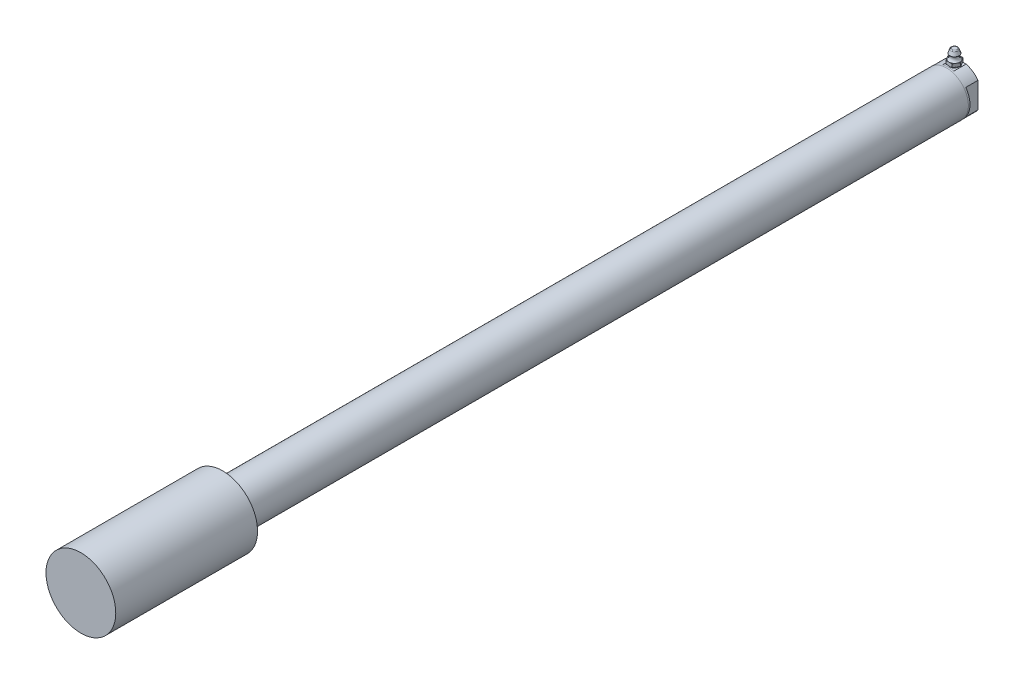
ISO-10303-21;
HEADER;
FILE_DESCRIPTION(('STEP AP214'),'2;1');
FILE_NAME('part.step','',(''),(''),'','','');
FILE_SCHEMA(('AUTOMOTIVE_DESIGN { 1 0 10303 214 1 1 1 1 }'));
ENDSEC;
DATA;
#1=APPLICATION_CONTEXT('core data for automotive mechanical design processes');
#2=APPLICATION_PROTOCOL_DEFINITION('international standard','automotive_design',2000,#1);
#3=PRODUCT_CONTEXT('',#1,'mechanical');
#4=PRODUCT('Part','Part','',(#3));
#5=PRODUCT_RELATED_PRODUCT_CATEGORY('part','',(#4));
#6=PRODUCT_DEFINITION_FORMATION('','',#4);
#7=PRODUCT_DEFINITION_CONTEXT('part definition',#1,'design');
#8=PRODUCT_DEFINITION('design','',#6,#7);
#9=PRODUCT_DEFINITION_SHAPE('','',#8);
#10=(LENGTH_UNIT() NAMED_UNIT(*) SI_UNIT(.MILLI.,.METRE.));
#11=(NAMED_UNIT(*) PLANE_ANGLE_UNIT() SI_UNIT($,.RADIAN.));
#12=(NAMED_UNIT(*) SI_UNIT($,.STERADIAN.) SOLID_ANGLE_UNIT());
#13=UNCERTAINTY_MEASURE_WITH_UNIT(LENGTH_MEASURE(1.E-05),#10,'distance_accuracy_value','');
#14=(GEOMETRIC_REPRESENTATION_CONTEXT(3) GLOBAL_UNCERTAINTY_ASSIGNED_CONTEXT((#13)) GLOBAL_UNIT_ASSIGNED_CONTEXT((#10,
#11,#12)) REPRESENTATION_CONTEXT('',''));
#15=CARTESIAN_POINT('',(0.,0.,0.));
#16=DIRECTION('',(0.,0.,1.));
#17=DIRECTION('',(1.,0.,0.));
#18=AXIS2_PLACEMENT_3D('',#15,#16,#17);
#19=CARTESIAN_POINT('',(0.,0.,10.16));
#20=DIRECTION('',(0.,0.,-1.));
#21=DIRECTION('',(-1.,0.,0.));
#22=AXIS2_PLACEMENT_3D('',#19,#20,#21);
#23=PLANE('',#22);
#24=CARTESIAN_POINT('',(0.,9.525,10.16));
#25=DIRECTION('',(0.,0.,-1.));
#26=DIRECTION('',(-1.,0.,0.));
#27=AXIS2_PLACEMENT_3D('',#24,#25,#26);
#28=CIRCLE('',#27,0.79375);
#29=CARTESIAN_POINT('',(-0.793749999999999,9.525,10.16));
#30=VERTEX_POINT('',#29);
#31=EDGE_CURVE('E259',#30,#30,#28,.T.);
#32=ORIENTED_EDGE('',*,*,#31,.T.);
#33=EDGE_LOOP('',(#32));
#34=FACE_BOUND('',#33,.T.);
#35=ADVANCED_FACE('F16',(#34),#23,.T.);
#36=CARTESIAN_POINT('',(0.,0.,10.16));
#37=DIRECTION('',(0.,0.,-1.));
#38=DIRECTION('',(-1.,0.,0.));
#39=AXIS2_PLACEMENT_3D('',#36,#37,#38);
#40=CIRCLE('',#39,15.7607);
#41=CARTESIAN_POINT('',(-15.7607,0.,10.16));
#42=VERTEX_POINT('',#41);
#43=EDGE_CURVE('E262',#42,#42,#40,.T.);
#44=ORIENTED_EDGE('',*,*,#43,.F.);
#45=EDGE_LOOP('',(#44));
#46=FACE_BOUND('',#45,.T.);
#47=CARTESIAN_POINT('',(0.,0.,10.16));
#48=DIRECTION('',(0.,0.,-1.));
#49=DIRECTION('',(-1.,0.,0.));
#50=AXIS2_PLACEMENT_3D('',#47,#48,#49);
#51=CIRCLE('',#50,15.8496);
#52=CARTESIAN_POINT('',(-15.8496,0.,10.16));
#53=VERTEX_POINT('',#52);
#54=EDGE_CURVE('E253',#53,#53,#51,.T.);
#55=ORIENTED_EDGE('',*,*,#54,.T.);
#56=EDGE_LOOP('',(#55));
#57=FACE_BOUND('',#56,.T.);
#58=ADVANCED_FACE('F425',(#46,#57),#23,.T.);
#59=CARTESIAN_POINT('',(0.,0.,549.7446000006));
#60=DIRECTION('',(0.,0.,-1.));
#61=DIRECTION('',(-1.,0.,0.));
#62=AXIS2_PLACEMENT_3D('',#59,#60,#61);
#63=CYLINDRICAL_SURFACE('',#62,15.8496);
#64=CARTESIAN_POINT('',(0.,0.,537.2986000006));
#65=DIRECTION('',(0.,0.,-1.));
#66=DIRECTION('',(-1.,0.,0.));
#67=AXIS2_PLACEMENT_3D('',#64,#65,#66);
#68=CIRCLE('',#67,15.8496);
#69=CARTESIAN_POINT('',(-15.8496,0.,537.2986000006));
#70=VERTEX_POINT('',#69);
#71=EDGE_CURVE('E256',#70,#70,#68,.F.);
#72=ORIENTED_EDGE('',*,*,#71,.F.);
#73=EDGE_LOOP('',(#72));
#74=FACE_BOUND('',#73,.T.);
#75=ORIENTED_EDGE('',*,*,#54,.F.);
#76=EDGE_LOOP('',(#75));
#77=FACE_BOUND('',#76,.T.);
#78=ADVANCED_FACE('F416',(#74,#77),#63,.T.);
#79=CARTESIAN_POINT('',(0.,0.,537.2986000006));
#80=DIRECTION('',(0.,0.,-1.));
#81=DIRECTION('',(-1.,0.,0.));
#82=AXIS2_PLACEMENT_3D('',#79,#80,#81);
#83=PLANE('',#82);
#84=ORIENTED_EDGE('',*,*,#71,.T.);
#85=EDGE_LOOP('',(#84));
#86=FACE_BOUND('',#85,.T.);
#87=CARTESIAN_POINT('',(0.,0.,537.2986000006));
#88=DIRECTION('',(0.,0.,-1.));
#89=DIRECTION('',(-1.,0.,0.));
#90=AXIS2_PLACEMENT_3D('',#87,#88,#89);
#91=CIRCLE('',#90,25.4);
#92=CARTESIAN_POINT('',(-25.4,0.,537.2986000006));
#93=VERTEX_POINT('',#92);
#94=EDGE_CURVE('E247',#93,#93,#91,.T.);
#95=ORIENTED_EDGE('',*,*,#94,.T.);
#96=EDGE_LOOP('',(#95));
#97=FACE_BOUND('',#96,.T.);
#98=ADVANCED_FACE('F412',(#86,#97),#83,.T.);
#99=CARTESIAN_POINT('',(0.,0.,640.5496000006));
#100=DIRECTION('',(0.,0.,1.));
#101=DIRECTION('',(1.,0.,0.));
#102=AXIS2_PLACEMENT_3D('',#99,#100,#101);
#103=PLANE('',#102);
#104=CARTESIAN_POINT('',(0.,0.,640.5496000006));
#105=DIRECTION('',(0.,0.,1.));
#106=DIRECTION('',(1.,0.,0.));
#107=AXIS2_PLACEMENT_3D('',#104,#105,#106);
#108=CIRCLE('',#107,25.4);
#109=CARTESIAN_POINT('',(25.4,0.,640.5496000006));
#110=VERTEX_POINT('',#109);
#111=EDGE_CURVE('E250',#110,#110,#108,.T.);
#112=ORIENTED_EDGE('',*,*,#111,.T.);
#113=EDGE_LOOP('',(#112));
#114=FACE_BOUND('',#113,.T.);
#115=ADVANCED_FACE('F415',(#114),#103,.T.);
#116=CARTESIAN_POINT('',(0.,0.,640.5496000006));
#117=DIRECTION('',(0.,0.,-1.));
#118=DIRECTION('',(-1.,0.,0.));
#119=AXIS2_PLACEMENT_3D('',#116,#117,#118);
#120=CYLINDRICAL_SURFACE('',#119,25.4);
#121=ORIENTED_EDGE('',*,*,#111,.F.);
#122=EDGE_LOOP('',(#121));
#123=FACE_BOUND('',#122,.T.);
#124=ORIENTED_EDGE('',*,*,#94,.F.);
#125=EDGE_LOOP('',(#124));
#126=FACE_BOUND('',#125,.T.);
#127=ADVANCED_FACE('F420',(#123,#126),#120,.T.);
#128=CARTESIAN_POINT('',(0.,0.,33.0708));
#129=DIRECTION('',(0.,0.,-1.));
#130=DIRECTION('',(0.,1.,0.));
#131=AXIS2_PLACEMENT_3D('',#128,#129,#130);
#132=CONICAL_SURFACE('',#131,7.25,1.02974425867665);
#133=CARTESIAN_POINT('',(0.,0.,37.4270394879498));
#134=VERTEX_POINT('',#133);
#135=VERTEX_LOOP('',#134);
#136=FACE_BOUND('',#135,.T.);
#137=CARTESIAN_POINT('',(0.,0.,33.0708));
#138=DIRECTION('',(0.,0.,-1.));
#139=DIRECTION('',(0.,1.,0.));
#140=AXIS2_PLACEMENT_3D('',#137,#138,#139);
#141=CIRCLE('',#140,7.25);
#142=CARTESIAN_POINT('',(0.,7.25,33.0708));
#143=VERTEX_POINT('',#142);
#144=EDGE_CURVE('E268',#143,#143,#141,.T.);
#145=ORIENTED_EDGE('',*,*,#144,.T.);
#146=EDGE_LOOP('',(#145));
#147=FACE_BOUND('',#146,.T.);
#148=ADVANCED_FACE('F337',(#136,#147),#132,.F.);
#149=CARTESIAN_POINT('',(0.,0.,0.));
#150=DIRECTION('',(0.,0.,-1.));
#151=DIRECTION('',(0.,1.,0.));
#152=AXIS2_PLACEMENT_3D('',#149,#150,#151);
#153=CYLINDRICAL_SURFACE('',#152,7.25);
#154=ORIENTED_EDGE('',*,*,#144,.F.);
#155=EDGE_LOOP('',(#154));
#156=FACE_BOUND('',#155,.T.);
#157=CARTESIAN_POINT('',(0.,0.,0.));
#158=DIRECTION('',(0.,0.,-1.));
#159=DIRECTION('',(0.,1.,0.));
#160=AXIS2_PLACEMENT_3D('',#157,#158,#159);
#161=CIRCLE('',#160,7.25);
#162=CARTESIAN_POINT('',(0.,7.25,0.));
#163=VERTEX_POINT('',#162);
#164=EDGE_CURVE('E265',#163,#163,#161,.T.);
#165=ORIENTED_EDGE('',*,*,#164,.T.);
#166=EDGE_LOOP('',(#165));
#167=FACE_BOUND('',#166,.T.);
#168=ADVANCED_FACE('F429',(#156,#167),#153,.F.);
#169=CARTESIAN_POINT('',(0.,0.,8.89));
#170=DIRECTION('',(0.,0.,-1.));
#171=DIRECTION('',(0.,1.,0.));
#172=AXIS2_PLACEMENT_3D('',#169,#170,#171);
#173=PLANE('',#172);
#174=CARTESIAN_POINT('',(0.,0.,8.89));
#175=DIRECTION('',(0.,0.,-1.));
#176=DIRECTION('',(0.,1.,0.));
#177=AXIS2_PLACEMENT_3D('',#174,#175,#176);
#178=CIRCLE('',#177,15.7607);
#179=CARTESIAN_POINT('',(12.7,9.33325583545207,8.89));
#180=VERTEX_POINT('',#179);
#181=CARTESIAN_POINT('',(12.7,-9.33325583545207,8.89));
#182=VERTEX_POINT('',#181);
#183=EDGE_CURVE('E303',#180,#182,#178,.T.);
#184=ORIENTED_EDGE('',*,*,#183,.T.);
#185=DIRECTION('',(0.,1.,0.));
#186=VECTOR('',#185,1.);
#187=CARTESIAN_POINT('',(12.7,-9.33325583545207,8.89));
#188=LINE('',#187,#186);
#189=EDGE_CURVE('E305',#182,#180,#188,.T.);
#190=ORIENTED_EDGE('',*,*,#189,.T.);
#191=EDGE_LOOP('',(#184,#190));
#192=FACE_BOUND('',#191,.T.);
#193=ADVANCED_FACE('F355',(#192),#173,.T.);
#194=CARTESIAN_POINT('',(12.7,-9.33325583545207,8.89));
#195=DIRECTION('',(-1.,0.,0.));
#196=DIRECTION('',(0.,0.,1.));
#197=AXIS2_PLACEMENT_3D('',#194,#195,#196);
#198=PLANE('',#197);
#199=DIRECTION('',(0.,1.,0.));
#200=VECTOR('',#199,1.);
#201=CARTESIAN_POINT('',(12.7,-9.33325583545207,0.));
#202=LINE('',#201,#200);
#203=CARTESIAN_POINT('',(12.7,-9.33325583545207,0.));
#204=VERTEX_POINT('',#203);
#205=CARTESIAN_POINT('',(12.7,9.33325583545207,0.));
#206=VERTEX_POINT('',#205);
#207=EDGE_CURVE('E301',#204,#206,#202,.T.);
#208=ORIENTED_EDGE('',*,*,#207,.T.);
#209=DIRECTION('',(0.,0.,-1.));
#210=VECTOR('',#209,1.);
#211=CARTESIAN_POINT('',(12.7,9.33325583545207,8.89));
#212=LINE('',#211,#210);
#213=EDGE_CURVE('E311',#180,#206,#212,.T.);
#214=ORIENTED_EDGE('',*,*,#213,.F.);
#215=ORIENTED_EDGE('',*,*,#189,.F.);
#216=DIRECTION('',(0.,0.,-1.));
#217=VECTOR('',#216,1.);
#218=CARTESIAN_POINT('',(12.7,-9.33325583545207,8.89));
#219=LINE('',#218,#217);
#220=EDGE_CURVE('E308',#182,#204,#219,.T.);
#221=ORIENTED_EDGE('',*,*,#220,.T.);
#222=EDGE_LOOP('',(#208,#214,#215,#221));
#223=FACE_BOUND('',#222,.T.);
#224=ADVANCED_FACE('F439',(#223),#198,.F.);
#225=CARTESIAN_POINT('',(0.,0.,8.89));
#226=DIRECTION('',(0.,0.,-1.));
#227=DIRECTION('',(0.,1.,0.));
#228=AXIS2_PLACEMENT_3D('',#225,#226,#227);
#229=PLANE('',#228);
#230=CARTESIAN_POINT('',(0.,0.,8.89));
#231=DIRECTION('',(0.,0.,-1.));
#232=DIRECTION('',(0.,1.,0.));
#233=AXIS2_PLACEMENT_3D('',#230,#231,#232);
#234=CIRCLE('',#233,15.7607);
#235=CARTESIAN_POINT('',(-12.7,-9.33325583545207,8.89));
#236=VERTEX_POINT('',#235);
#237=CARTESIAN_POINT('',(-12.7,9.33325583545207,8.89));
#238=VERTEX_POINT('',#237);
#239=EDGE_CURVE('E291',#236,#238,#234,.T.);
#240=ORIENTED_EDGE('',*,*,#239,.T.);
#241=DIRECTION('',(0.,-1.,0.));
#242=VECTOR('',#241,1.);
#243=CARTESIAN_POINT('',(-12.7,-9.33325583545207,8.89));
#244=LINE('',#243,#242);
#245=EDGE_CURVE('E293',#238,#236,#244,.T.);
#246=ORIENTED_EDGE('',*,*,#245,.T.);
#247=EDGE_LOOP('',(#240,#246));
#248=FACE_BOUND('',#247,.T.);
#249=ADVANCED_FACE('F352',(#248),#229,.T.);
#250=CARTESIAN_POINT('',(-12.7,-9.33325583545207,8.89));
#251=DIRECTION('',(1.,0.,0.));
#252=DIRECTION('',(0.,0.,-1.));
#253=AXIS2_PLACEMENT_3D('',#250,#251,#252);
#254=PLANE('',#253);
#255=DIRECTION('',(0.,-1.,0.));
#256=VECTOR('',#255,1.);
#257=CARTESIAN_POINT('',(-12.7,-9.33325583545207,0.));
#258=LINE('',#257,#256);
#259=CARTESIAN_POINT('',(-12.7,9.33325583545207,0.));
#260=VERTEX_POINT('',#259);
#261=CARTESIAN_POINT('',(-12.7,-9.33325583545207,0.));
#262=VERTEX_POINT('',#261);
#263=EDGE_CURVE('E288',#260,#262,#258,.T.);
#264=ORIENTED_EDGE('',*,*,#263,.T.);
#265=DIRECTION('',(0.,0.,-1.));
#266=VECTOR('',#265,1.);
#267=CARTESIAN_POINT('',(-12.7,-9.33325583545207,8.89));
#268=LINE('',#267,#266);
#269=EDGE_CURVE('E298',#236,#262,#268,.T.);
#270=ORIENTED_EDGE('',*,*,#269,.F.);
#271=ORIENTED_EDGE('',*,*,#245,.F.);
#272=DIRECTION('',(0.,0.,-1.));
#273=VECTOR('',#272,1.);
#274=CARTESIAN_POINT('',(-12.7,9.33325583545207,8.89));
#275=LINE('',#274,#273);
#276=EDGE_CURVE('E296',#238,#260,#275,.T.);
#277=ORIENTED_EDGE('',*,*,#276,.T.);
#278=EDGE_LOOP('',(#264,#270,#271,#277));
#279=FACE_BOUND('',#278,.T.);
#280=ADVANCED_FACE('F342',(#279),#254,.F.);
#281=CARTESIAN_POINT('',(0.,8.89,4.445));
#282=DIRECTION('',(0.,1.,0.));
#283=DIRECTION('',(0.,0.,1.));
#284=AXIS2_PLACEMENT_3D('',#281,#282,#283);
#285=PLANE('',#284);
#286=DIRECTION('',(0.,0.,-1.));
#287=VECTOR('',#286,1.);
#288=CARTESIAN_POINT('',(-0.476249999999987,8.89,0.));
#289=LINE('',#288,#287);
#290=CARTESIAN_POINT('',(-0.476249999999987,8.89,1.9500479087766));
#291=VERTEX_POINT('',#290);
#292=CARTESIAN_POINT('',(-0.476249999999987,8.89,6.9399520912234));
#293=VERTEX_POINT('',#292);
#294=EDGE_CURVE('E274',#291,#293,#289,.F.);
#295=ORIENTED_EDGE('',*,*,#294,.F.);
#296=CARTESIAN_POINT('',(0.,8.89,4.445));
#297=DIRECTION('',(0.,1.,0.));
#298=DIRECTION('',(0.,0.,1.));
#299=AXIS2_PLACEMENT_3D('',#296,#297,#298);
#300=CIRCLE('',#299,2.54);
#301=EDGE_CURVE('E277',#291,#293,#300,.T.);
#302=ORIENTED_EDGE('',*,*,#301,.T.);
#303=EDGE_LOOP('',(#295,#302));
#304=FACE_BOUND('',#303,.T.);
#305=ADVANCED_FACE('F338',(#304),#285,.T.);
#306=CARTESIAN_POINT('',(0.,8.89,4.445));
#307=DIRECTION('',(0.,1.,0.));
#308=DIRECTION('',(0.,0.,1.));
#309=AXIS2_PLACEMENT_3D('',#306,#307,#308);
#310=CYLINDRICAL_SURFACE('',#309,2.54);
#311=CARTESIAN_POINT('',(0.,11.509375,4.445));
#312=DIRECTION('',(0.,-1.,0.));
#313=DIRECTION('',(0.,0.,-1.));
#314=AXIS2_PLACEMENT_3D('',#311,#312,#313);
#315=CIRCLE('',#314,2.54);
#316=CARTESIAN_POINT('',(0.,11.509375,1.905));
#317=VERTEX_POINT('',#316);
#318=EDGE_CURVE('E10',#317,#317,#315,.T.);
#319=ORIENTED_EDGE('',*,*,#318,.F.);
#320=EDGE_LOOP('',(#319));
#321=FACE_BOUND('',#320,.T.);
#322=CARTESIAN_POINT('',(0.476249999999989,8.89,6.9399520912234));
#323=VERTEX_POINT('',#322);
#324=CARTESIAN_POINT('',(0.476249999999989,8.89,1.9500479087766));
#325=VERTEX_POINT('',#324);
#326=EDGE_CURVE('E278',#323,#325,#300,.T.);
#327=ORIENTED_EDGE('',*,*,#326,.F.);
#328=CARTESIAN_POINT('',(0.476249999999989,8.89,6.9399520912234));
#329=CARTESIAN_POINT('',(0.512180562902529,8.91691864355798,6.9330998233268));
#330=CARTESIAN_POINT('',(0.545747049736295,8.94688245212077,6.92588053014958));
#331=CARTESIAN_POINT('',(0.607407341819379,9.01206705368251,6.91150614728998));
#332=CARTESIAN_POINT('',(0.635495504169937,9.04729320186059,6.90435113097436));
#333=CARTESIAN_POINT('',(0.685398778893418,9.12214189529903,6.89091525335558));
#334=CARTESIAN_POINT('',(0.707208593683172,9.16176811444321,6.8846351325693));
#335=CARTESIAN_POINT('',(0.743834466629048,9.24431396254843,6.87371921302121));
#336=CARTESIAN_POINT('',(0.758656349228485,9.28723081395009,6.86908204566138));
#337=CARTESIAN_POINT('',(0.78052508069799,9.37408168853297,6.86212860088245));
#338=CARTESIAN_POINT('',(0.787750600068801,9.41796631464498,6.85975911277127));
#339=CARTESIAN_POINT('',(0.794769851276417,9.50639423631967,6.85745841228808));
#340=CARTESIAN_POINT('',(0.794563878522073,9.55093750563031,6.85752710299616));
#341=CARTESIAN_POINT('',(0.786887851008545,9.63751728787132,6.86004066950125));
#342=CARTESIAN_POINT('',(0.77970854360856,9.67958282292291,6.8623904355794));
#343=CARTESIAN_POINT('',(0.758770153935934,9.76187540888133,6.8690435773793));
#344=CARTESIAN_POINT('',(0.74501085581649,9.80210239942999,6.87334701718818));
#345=CARTESIAN_POINT('',(0.711121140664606,9.88022362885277,6.8834876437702));
#346=CARTESIAN_POINT('',(0.690906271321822,9.91807850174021,6.88934497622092));
#347=CARTESIAN_POINT('',(0.644735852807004,9.98995201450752,6.90192629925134));
#348=CARTESIAN_POINT('',(0.618778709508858,10.0239695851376,6.90865053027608));
#349=CARTESIAN_POINT('',(0.56046206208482,10.0888338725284,6.92258340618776));
#350=CARTESIAN_POINT('',(0.527864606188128,10.1194652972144,6.92980015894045));
#351=CARTESIAN_POINT('',(0.457912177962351,10.1748820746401,6.94363682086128));
#352=CARTESIAN_POINT('',(0.420556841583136,10.1996669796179,6.95025668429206));
#353=CARTESIAN_POINT('',(0.341692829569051,10.2428601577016,6.96223030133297));
#354=CARTESIAN_POINT('',(0.300150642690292,10.2612106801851,6.96757245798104));
#355=CARTESIAN_POINT('',(0.214363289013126,10.2905987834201,6.97630480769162));
#356=CARTESIAN_POINT('',(0.170118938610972,10.3016385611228,6.97969558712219));
#357=CARTESIAN_POINT('',(0.0820002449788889,10.3157143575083,6.98404453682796));
#358=CARTESIAN_POINT('',(0.0381765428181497,10.3190405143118,6.98509083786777));
#359=CARTESIAN_POINT('',(-0.0494102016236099,10.3184197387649,6.98489674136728));
#360=CARTESIAN_POINT('',(-0.0931732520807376,10.3144739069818,6.98365668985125));
#361=CARTESIAN_POINT('',(-0.178230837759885,10.2996543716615,6.97908822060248));
#362=CARTESIAN_POINT('',(-0.219559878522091,10.2889603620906,6.97581400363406));
#363=CARTESIAN_POINT('',(-0.299823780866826,10.2611719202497,6.9675651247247));
#364=CARTESIAN_POINT('',(-0.338758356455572,10.2440767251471,6.96259026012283));
#365=CARTESIAN_POINT('',(-0.414155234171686,10.2035206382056,6.9513048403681));
#366=CARTESIAN_POINT('',(-0.450537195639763,10.1799186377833,6.94496545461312));
#367=CARTESIAN_POINT('',(-0.518921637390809,10.1271835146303,6.93167164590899));
#368=CARTESIAN_POINT('',(-0.550922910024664,10.0980488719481,6.92471705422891));
#369=CARTESIAN_POINT('',(-0.610964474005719,10.0336982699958,6.91062613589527));
#370=CARTESIAN_POINT('',(-0.638795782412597,9.99828605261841,6.90349362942));
#371=CARTESIAN_POINT('',(-0.688142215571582,9.92314483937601,6.89014130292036));
#372=CARTESIAN_POINT('',(-0.709657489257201,9.88341594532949,6.88392146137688));
#373=CARTESIAN_POINT('',(-0.745648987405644,9.80080746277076,6.87316011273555));
#374=CARTESIAN_POINT('',(-0.760145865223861,9.75793755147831,6.86861369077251));
#375=CARTESIAN_POINT('',(-0.781663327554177,9.67019028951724,6.86176071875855));
#376=CARTESIAN_POINT('',(-0.788686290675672,9.62531358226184,6.85945345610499));
#377=CARTESIAN_POINT('',(-0.794836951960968,9.5370006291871,6.85743521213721));
#378=CARTESIAN_POINT('',(-0.794305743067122,9.49359044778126,6.8576120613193));
#379=CARTESIAN_POINT('',(-0.786196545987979,9.4075177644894,6.86026661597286));
#380=CARTESIAN_POINT('',(-0.778620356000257,9.36485507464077,6.86274373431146));
#381=CARTESIAN_POINT('',(-0.756875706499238,9.282145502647,6.86963707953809));
#382=CARTESIAN_POINT('',(-0.742813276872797,9.24206794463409,6.87402205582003));
#383=CARTESIAN_POINT('',(-0.708573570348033,9.16478940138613,6.88422981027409));
#384=CARTESIAN_POINT('',(-0.688391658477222,9.12759062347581,6.89005367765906));
#385=CARTESIAN_POINT('',(-0.640095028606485,9.0533309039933,6.90316243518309));
#386=CARTESIAN_POINT('',(-0.611378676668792,9.01667605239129,6.91053593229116));
#387=CARTESIAN_POINT('',(-0.548033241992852,8.94892538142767,6.92538804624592));
#388=CARTESIAN_POINT('',(-0.513404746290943,8.91782901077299,6.93286665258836));
#389=CARTESIAN_POINT('',(-0.476249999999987,8.89,6.9399520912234));
#390=B_SPLINE_CURVE_WITH_KNOTS('',3,(#328,#329,#330,#331,#332,#333,#334,#335,#336,#337,#338,
#339,#340,#341,#342,#343,#344,#345,#346,#347,#348,#349,#350,#351,#352,#353,#354,#355,#356,#357,
#358,#359,#360,#361,#362,#363,#364,#365,#366,#367,#368,#369,#370,#371,#372,#373,#374,#375,#376,
#377,#378,#379,#380,#381,#382,#383,#384,#385,#386,#387,#388,#389),.UNSPECIFIED.,.F.,.F.,(4,2,2,
2,2,2,2,2,2,2,2,2,2,2,2,2,2,2,2,2,2,2,2,2,2,2,2,2,2,2,4),(0.,0.136076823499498,
0.272293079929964,0.40862393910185,0.544840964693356,0.677777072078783,0.810707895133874,
0.938324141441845,1.06594457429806,1.19530809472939,1.32470757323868,1.46000697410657,
1.59531673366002,1.73181159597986,1.86826542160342,1.99949710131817,2.13070892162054,
2.25856623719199,2.3864387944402,2.51733833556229,2.64827389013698,2.78443364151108,
2.92059018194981,3.05634357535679,3.19205375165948,3.32165645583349,3.45122608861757,
3.57874888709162,3.70636851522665,3.84708791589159,3.9877933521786),.UNSPECIFIED.);
#391=EDGE_CURVE('E20',#323,#293,#390,.T.);
#392=ORIENTED_EDGE('',*,*,#391,.T.);
#393=ORIENTED_EDGE('',*,*,#301,.F.);
#394=CARTESIAN_POINT('',(-0.476249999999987,8.89,1.9500479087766));
#395=CARTESIAN_POINT('',(-0.512180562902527,8.91691864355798,1.9569001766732));
#396=CARTESIAN_POINT('',(-0.545747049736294,8.94688245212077,1.96411946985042));
#397=CARTESIAN_POINT('',(-0.607407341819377,9.01206705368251,1.97849385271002));
#398=CARTESIAN_POINT('',(-0.635495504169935,9.04729320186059,1.98564886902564));
#399=CARTESIAN_POINT('',(-0.685398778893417,9.12214189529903,1.99908474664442));
#400=CARTESIAN_POINT('',(-0.707208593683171,9.16176811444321,2.0053648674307));
#401=CARTESIAN_POINT('',(-0.743834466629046,9.24431396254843,2.01628078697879));
#402=CARTESIAN_POINT('',(-0.758656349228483,9.28723081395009,2.02091795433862));
#403=CARTESIAN_POINT('',(-0.780525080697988,9.37408168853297,2.02787139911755));
#404=CARTESIAN_POINT('',(-0.787750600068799,9.41796631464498,2.03024088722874));
#405=CARTESIAN_POINT('',(-0.794769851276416,9.50639423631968,2.03254158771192));
#406=CARTESIAN_POINT('',(-0.794563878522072,9.55093750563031,2.03247289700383));
#407=CARTESIAN_POINT('',(-0.786887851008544,9.63751728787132,2.02995933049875));
#408=CARTESIAN_POINT('',(-0.779708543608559,9.67958282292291,2.0276095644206));
#409=CARTESIAN_POINT('',(-0.758770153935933,9.76187540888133,2.0209564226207));
#410=CARTESIAN_POINT('',(-0.745010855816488,9.80210239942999,2.01665298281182));
#411=CARTESIAN_POINT('',(-0.711121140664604,9.88022362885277,2.0065123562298));
#412=CARTESIAN_POINT('',(-0.69090627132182,9.91807850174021,2.00065502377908));
#413=CARTESIAN_POINT('',(-0.644735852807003,9.98995201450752,1.98807370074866));
#414=CARTESIAN_POINT('',(-0.618778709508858,10.0239695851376,1.98134946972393));
#415=CARTESIAN_POINT('',(-0.56046206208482,10.0888338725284,1.96741659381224));
#416=CARTESIAN_POINT('',(-0.527864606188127,10.1194652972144,1.96019984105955));
#417=CARTESIAN_POINT('',(-0.457912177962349,10.1748820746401,1.94636317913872));
#418=CARTESIAN_POINT('',(-0.420556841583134,10.1996669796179,1.93974331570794));
#419=CARTESIAN_POINT('',(-0.341692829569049,10.2428601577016,1.92776969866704));
#420=CARTESIAN_POINT('',(-0.300150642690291,10.2612106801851,1.92242754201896));
#421=CARTESIAN_POINT('',(-0.214363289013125,10.2905987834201,1.91369519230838));
#422=CARTESIAN_POINT('',(-0.170118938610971,10.3016385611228,1.91030441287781));
#423=CARTESIAN_POINT('',(-0.082000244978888,10.3157143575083,1.90595546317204));
#424=CARTESIAN_POINT('',(-0.0381765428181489,10.3190405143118,1.90490916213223));
#425=CARTESIAN_POINT('',(0.0494102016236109,10.3184197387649,1.90510325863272));
#426=CARTESIAN_POINT('',(0.0931732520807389,10.3144739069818,1.90634331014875));
#427=CARTESIAN_POINT('',(0.178230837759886,10.2996543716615,1.91091177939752));
#428=CARTESIAN_POINT('',(0.219559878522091,10.2889603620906,1.91418599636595));
#429=CARTESIAN_POINT('',(0.299823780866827,10.2611719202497,1.9224348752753));
#430=CARTESIAN_POINT('',(0.338758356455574,10.2440767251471,1.92740973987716));
#431=CARTESIAN_POINT('',(0.414155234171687,10.2035206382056,1.93869515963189));
#432=CARTESIAN_POINT('',(0.450537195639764,10.1799186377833,1.94503454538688));
#433=CARTESIAN_POINT('',(0.51892163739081,10.1271835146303,1.95832835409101));
#434=CARTESIAN_POINT('',(0.550922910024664,10.0980488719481,1.96528294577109));
#435=CARTESIAN_POINT('',(0.61096447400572,10.0336982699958,1.97937386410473));
#436=CARTESIAN_POINT('',(0.638795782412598,9.99828605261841,1.98650637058));
#437=CARTESIAN_POINT('',(0.688142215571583,9.92314483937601,1.99985869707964));
#438=CARTESIAN_POINT('',(0.709657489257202,9.88341594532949,2.00607853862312));
#439=CARTESIAN_POINT('',(0.745648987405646,9.80080746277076,2.01683988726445));
#440=CARTESIAN_POINT('',(0.760145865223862,9.75793755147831,2.02138630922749));
#441=CARTESIAN_POINT('',(0.781663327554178,9.67019028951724,2.02823928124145));
#442=CARTESIAN_POINT('',(0.788686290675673,9.62531358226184,2.03054654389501));
#443=CARTESIAN_POINT('',(0.794836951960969,9.5370006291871,2.0325647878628));
#444=CARTESIAN_POINT('',(0.794305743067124,9.49359044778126,2.03238793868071));
#445=CARTESIAN_POINT('',(0.786196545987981,9.4075177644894,2.02973338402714));
#446=CARTESIAN_POINT('',(0.778620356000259,9.36485507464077,2.02725626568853));
#447=CARTESIAN_POINT('',(0.75687570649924,9.28214550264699,2.02036292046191));
#448=CARTESIAN_POINT('',(0.742813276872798,9.24206794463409,2.01597794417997));
#449=CARTESIAN_POINT('',(0.708573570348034,9.16478940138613,2.00577018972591));
#450=CARTESIAN_POINT('',(0.688391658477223,9.12759062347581,1.99994632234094));
#451=CARTESIAN_POINT('',(0.640095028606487,9.0533309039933,1.98683756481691));
#452=CARTESIAN_POINT('',(0.611378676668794,9.01667605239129,1.97946406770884));
#453=CARTESIAN_POINT('',(0.548033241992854,8.94892538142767,1.96461195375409));
#454=CARTESIAN_POINT('',(0.513404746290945,8.91782901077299,1.95713334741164));
#455=CARTESIAN_POINT('',(0.476249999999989,8.89,1.9500479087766));
#456=B_SPLINE_CURVE_WITH_KNOTS('',3,(#394,#395,#396,#397,#398,#399,#400,#401,#402,#403,#404,
#405,#406,#407,#408,#409,#410,#411,#412,#413,#414,#415,#416,#417,#418,#419,#420,#421,#422,#423,
#424,#425,#426,#427,#428,#429,#430,#431,#432,#433,#434,#435,#436,#437,#438,#439,#440,#441,#442,
#443,#444,#445,#446,#447,#448,#449,#450,#451,#452,#453,#454,#455),.UNSPECIFIED.,.F.,.F.,(4,2,2,
2,2,2,2,2,2,2,2,2,2,2,2,2,2,2,2,2,2,2,2,2,2,2,2,2,2,2,4),(0.,0.136076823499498,
0.272293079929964,0.40862393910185,0.544840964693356,0.677777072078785,0.810707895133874,
0.938324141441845,1.06594457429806,1.19530809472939,1.32470757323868,1.46000697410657,
1.59531673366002,1.73181159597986,1.86826542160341,1.99949710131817,2.13070892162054,
2.25856623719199,2.3864387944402,2.51733833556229,2.64827389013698,2.78443364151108,
2.92059018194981,3.05634357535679,3.19205375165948,3.32165645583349,3.45122608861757,
3.57874888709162,3.70636851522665,3.84708791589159,3.98779335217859),.UNSPECIFIED.);
#457=EDGE_CURVE('E321',#291,#325,#456,.T.);
#458=ORIENTED_EDGE('',*,*,#457,.T.);
#459=EDGE_LOOP('',(#327,#392,#393,#458));
#460=FACE_BOUND('',#459,.T.);
#461=ADVANCED_FACE('F326',(#321,#460),#310,.F.);
#462=DIRECTION('',(0.,0.,-1.));
#463=VECTOR('',#462,1.);
#464=CARTESIAN_POINT('',(0.476249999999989,8.89,0.));
#465=LINE('',#464,#463);
#466=EDGE_CURVE('E103',#323,#325,#465,.T.);
#467=ORIENTED_EDGE('',*,*,#466,.F.);
#468=ORIENTED_EDGE('',*,*,#326,.T.);
#469=EDGE_LOOP('',(#467,#468));
#470=FACE_BOUND('',#469,.T.);
#471=ADVANCED_FACE('F344',(#470),#285,.T.);
#472=CARTESIAN_POINT('',(0.,0.,0.));
#473=DIRECTION('',(0.,0.,-1.));
#474=DIRECTION('',(0.,1.,0.));
#475=AXIS2_PLACEMENT_3D('',#472,#473,#474);
#476=PLANE('',#475);
#477=ORIENTED_EDGE('',*,*,#164,.F.);
#478=EDGE_LOOP('',(#477));
#479=FACE_BOUND('',#478,.T.);
#480=CARTESIAN_POINT('',(0.,9.525,0.));
#481=DIRECTION('',(0.,0.,-1.));
#482=DIRECTION('',(0.,1.,0.));
#483=AXIS2_PLACEMENT_3D('',#480,#481,#482);
#484=CIRCLE('',#483,0.79375);
#485=CARTESIAN_POINT('',(0.,10.31875,0.));
#486=VERTEX_POINT('',#485);
#487=EDGE_CURVE('E271',#486,#486,#484,.T.);
#488=ORIENTED_EDGE('',*,*,#487,.F.);
#489=EDGE_LOOP('',(#488));
#490=FACE_BOUND('',#489,.T.);
#491=DIRECTION('',(-1.,0.,0.));
#492=VECTOR('',#491,1.);
#493=CARTESIAN_POINT('',(4.01771881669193,15.24,0.));
#494=LINE('',#493,#492);
#495=CARTESIAN_POINT('',(4.01771881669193,15.24,0.));
#496=VERTEX_POINT('',#495);
#497=CARTESIAN_POINT('',(-4.01771881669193,15.24,0.));
#498=VERTEX_POINT('',#497);
#499=EDGE_CURVE('E281',#496,#498,#494,.T.);
#500=ORIENTED_EDGE('',*,*,#499,.F.);
#501=CARTESIAN_POINT('',(0.,0.,0.));
#502=DIRECTION('',(0.,0.,-1.));
#503=DIRECTION('',(0.,1.,0.));
#504=AXIS2_PLACEMENT_3D('',#501,#502,#503);
#505=CIRCLE('',#504,15.7607);
#506=EDGE_CURVE('E314',#496,#206,#505,.T.);
#507=ORIENTED_EDGE('',*,*,#506,.T.);
#508=ORIENTED_EDGE('',*,*,#207,.F.);
#509=EDGE_CURVE('E316',#204,#262,#505,.T.);
#510=ORIENTED_EDGE('',*,*,#509,.T.);
#511=ORIENTED_EDGE('',*,*,#263,.F.);
#512=EDGE_CURVE('E320',#260,#498,#505,.T.);
#513=ORIENTED_EDGE('',*,*,#512,.T.);
#514=EDGE_LOOP('',(#500,#507,#508,#510,#511,#513));
#515=FACE_BOUND('',#514,.T.);
#516=ADVANCED_FACE('F335',(#479,#490,#515),#476,.T.);
#517=CARTESIAN_POINT('',(0.,9.525,0.));
#518=DIRECTION('',(0.,0.,-1.));
#519=DIRECTION('',(0.,1.,0.));
#520=AXIS2_PLACEMENT_3D('',#517,#518,#519);
#521=CYLINDRICAL_SURFACE('',#520,0.79375);
#522=ORIENTED_EDGE('',*,*,#31,.F.);
#523=EDGE_LOOP('',(#522));
#524=FACE_BOUND('',#523,.T.);
#525=ORIENTED_EDGE('',*,*,#487,.T.);
#526=EDGE_LOOP('',(#525));
#527=FACE_BOUND('',#526,.T.);
#528=ORIENTED_EDGE('',*,*,#466,.T.);
#529=ORIENTED_EDGE('',*,*,#457,.F.);
#530=ORIENTED_EDGE('',*,*,#294,.T.);
#531=ORIENTED_EDGE('',*,*,#391,.F.);
#532=EDGE_LOOP('',(#528,#529,#530,#531));
#533=FACE_BOUND('',#532,.T.);
#534=ADVANCED_FACE('F330',(#524,#527,#533),#521,.F.);
#535=CARTESIAN_POINT('',(-4.01771881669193,15.24,8.89));
#536=DIRECTION('',(0.,0.,-1.));
#537=DIRECTION('',(0.,1.,0.));
#538=AXIS2_PLACEMENT_3D('',#535,#536,#537);
#539=PLANE('',#538);
#540=CARTESIAN_POINT('',(0.,0.,8.89));
#541=DIRECTION('',(0.,0.,-1.));
#542=DIRECTION('',(0.,1.,0.));
#543=AXIS2_PLACEMENT_3D('',#540,#541,#542);
#544=CIRCLE('',#543,15.7607);
#545=CARTESIAN_POINT('',(4.01771881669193,15.24,8.89));
#546=VERTEX_POINT('',#545);
#547=CARTESIAN_POINT('',(-4.01771881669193,15.24,8.89));
#548=VERTEX_POINT('',#547);
#549=EDGE_CURVE('E319',#546,#548,#544,.F.);
#550=ORIENTED_EDGE('',*,*,#549,.F.);
#551=DIRECTION('',(-1.,0.,0.));
#552=VECTOR('',#551,1.);
#553=CARTESIAN_POINT('',(4.01771881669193,15.24,8.89));
#554=LINE('',#553,#552);
#555=EDGE_CURVE('E282',#546,#548,#554,.T.);
#556=ORIENTED_EDGE('',*,*,#555,.T.);
#557=EDGE_LOOP('',(#550,#556));
#558=FACE_BOUND('',#557,.T.);
#559=ADVANCED_FACE('F334',(#558),#539,.T.);
#560=CARTESIAN_POINT('',(4.01771881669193,15.24,8.89));
#561=DIRECTION('',(0.,-1.,0.));
#562=DIRECTION('',(0.,0.,-1.));
#563=AXIS2_PLACEMENT_3D('',#560,#561,#562);
#564=PLANE('',#563);
#565=CARTESIAN_POINT('',(0.,15.24,4.445));
#566=DIRECTION('',(0.,-1.,0.));
#567=DIRECTION('',(1.,0.,0.));
#568=AXIS2_PLACEMENT_3D('',#565,#566,#567);
#569=CIRCLE('',#568,3.21504291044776);
#570=CARTESIAN_POINT('',(3.21504291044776,15.24,4.445));
#571=VERTEX_POINT('',#570);
#572=EDGE_CURVE('E32',#571,#571,#569,.F.);
#573=ORIENTED_EDGE('',*,*,#572,.F.);
#574=EDGE_LOOP('',(#573));
#575=FACE_BOUND('',#574,.T.);
#576=ORIENTED_EDGE('',*,*,#499,.T.);
#577=DIRECTION('',(0.,0.,-1.));
#578=VECTOR('',#577,1.);
#579=CARTESIAN_POINT('',(-4.01771881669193,15.24,8.89));
#580=LINE('',#579,#578);
#581=EDGE_CURVE('E285',#548,#498,#580,.T.);
#582=ORIENTED_EDGE('',*,*,#581,.F.);
#583=ORIENTED_EDGE('',*,*,#555,.F.);
#584=DIRECTION('',(0.,0.,-1.));
#585=VECTOR('',#584,1.);
#586=CARTESIAN_POINT('',(4.01771881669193,15.24,8.89));
#587=LINE('',#586,#585);
#588=EDGE_CURVE('E97',#546,#496,#587,.T.);
#589=ORIENTED_EDGE('',*,*,#588,.T.);
#590=EDGE_LOOP('',(#576,#582,#583,#589));
#591=FACE_BOUND('',#590,.T.);
#592=ADVANCED_FACE('F372',(#575,#591),#564,.F.);
#593=CARTESIAN_POINT('',(0.,0.,10.16));
#594=DIRECTION('',(0.,0.,-1.));
#595=DIRECTION('',(0.,1.,0.));
#596=AXIS2_PLACEMENT_3D('',#593,#594,#595);
#597=CYLINDRICAL_SURFACE('',#596,15.7607);
#598=ORIENTED_EDGE('',*,*,#588,.F.);
#599=ORIENTED_EDGE('',*,*,#549,.T.);
#600=ORIENTED_EDGE('',*,*,#581,.T.);
#601=ORIENTED_EDGE('',*,*,#512,.F.);
#602=ORIENTED_EDGE('',*,*,#276,.F.);
#603=ORIENTED_EDGE('',*,*,#239,.F.);
#604=ORIENTED_EDGE('',*,*,#269,.T.);
#605=ORIENTED_EDGE('',*,*,#509,.F.);
#606=ORIENTED_EDGE('',*,*,#220,.F.);
#607=ORIENTED_EDGE('',*,*,#183,.F.);
#608=ORIENTED_EDGE('',*,*,#213,.T.);
#609=ORIENTED_EDGE('',*,*,#506,.F.);
#610=EDGE_LOOP('',(#598,#599,#600,#601,#602,#603,#604,#605,#606,#607,#608,#609));
#611=FACE_BOUND('',#610,.T.);
#612=ORIENTED_EDGE('',*,*,#43,.T.);
#613=EDGE_LOOP('',(#612));
#614=FACE_BOUND('',#613,.T.);
#615=ADVANCED_FACE('F18',(#611,#614),#597,.T.);
#616=CARTESIAN_POINT('',(0.,25.4,4.445));
#617=DIRECTION('',(0.,1.,0.));
#618=DIRECTION('',(0.,0.,1.));
#619=AXIS2_PLACEMENT_3D('',#616,#617,#618);
#620=PLANE('',#619);
#621=CARTESIAN_POINT('',(0.,25.4,4.445));
#622=DIRECTION('',(0.,1.,0.));
#623=DIRECTION('',(0.,0.,1.));
#624=AXIS2_PLACEMENT_3D('',#621,#622,#623);
#625=CIRCLE('',#624,1.7474960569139);
#626=CARTESIAN_POINT('',(0.,25.4,6.1924960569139));
#627=VERTEX_POINT('',#626);
#628=EDGE_CURVE('E242',#627,#627,#625,.T.);
#629=ORIENTED_EDGE('',*,*,#628,.T.);
#630=EDGE_LOOP('',(#629));
#631=FACE_BOUND('',#630,.T.);
#632=ADVANCED_FACE('F359',(#631),#620,.T.);
#633=CARTESIAN_POINT('',(0.,24.638,4.445));
#634=DIRECTION('',(0.,1.,0.));
#635=DIRECTION('',(0.,0.,1.));
#636=AXIS2_PLACEMENT_3D('',#633,#634,#635);
#637=TOROIDAL_SURFACE('',#636,1.7474960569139,0.762);
#638=ORIENTED_EDGE('',*,*,#628,.F.);
#639=EDGE_LOOP('',(#638));
#640=FACE_BOUND('',#639,.T.);
#641=CARTESIAN_POINT('',(0.,24.8923915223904,4.445));
#642=DIRECTION('',(0.,1.,0.));
#643=DIRECTION('',(0.,0.,1.));
#644=AXIS2_PLACEMENT_3D('',#641,#642,#643);
#645=CIRCLE('',#644,2.46577800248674);
#646=CARTESIAN_POINT('',(0.,24.8923915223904,6.91077800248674));
#647=VERTEX_POINT('',#646);
#648=EDGE_CURVE('E239',#647,#647,#645,.F.);
#649=ORIENTED_EDGE('',*,*,#648,.F.);
#650=EDGE_LOOP('',(#649));
#651=FACE_BOUND('',#650,.T.);
#652=ADVANCED_FACE('F361',(#640,#651),#637,.T.);
#653=CARTESIAN_POINT('',(0.,22.352,4.445));
#654=DIRECTION('',(0.,-1.,0.));
#655=DIRECTION('',(0.,0.,-1.));
#656=AXIS2_PLACEMENT_3D('',#653,#654,#655);
#657=CONICAL_SURFACE('',#656,3.3655,0.340381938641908);
#658=ORIENTED_EDGE('',*,*,#648,.T.);
#659=EDGE_LOOP('',(#658));
#660=FACE_BOUND('',#659,.T.);
#661=CARTESIAN_POINT('',(0.,22.352,4.445));
#662=DIRECTION('',(0.,-1.,0.));
#663=DIRECTION('',(0.,0.,-1.));
#664=AXIS2_PLACEMENT_3D('',#661,#662,#663);
#665=CIRCLE('',#664,3.3655);
#666=CARTESIAN_POINT('',(0.,22.352,1.0795));
#667=VERTEX_POINT('',#666);
#668=EDGE_CURVE('E192',#667,#667,#665,.T.);
#669=ORIENTED_EDGE('',*,*,#668,.F.);
#670=EDGE_LOOP('',(#669));
#671=FACE_BOUND('',#670,.T.);
#672=ADVANCED_FACE('F369',(#660,#671),#657,.T.);
#673=CARTESIAN_POINT('',(0.,20.7536902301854,4.445));
#674=DIRECTION('',(0.,-1.,0.));
#675=DIRECTION('',(0.,0.,-1.));
#676=AXIS2_PLACEMENT_3D('',#673,#674,#675);
#677=TOROIDAL_SURFACE('',#676,5.20693450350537,2.43833450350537);
#678=ORIENTED_EDGE('',*,*,#668,.T.);
#679=EDGE_LOOP('',(#678));
#680=FACE_BOUND('',#679,.T.);
#681=CARTESIAN_POINT('',(0.,18.653125,4.445));
#682=DIRECTION('',(0.,-1.,0.));
#683=DIRECTION('',(0.,0.,-1.));
#684=AXIS2_PLACEMENT_3D('',#681,#682,#683);
#685=CIRCLE('',#684,3.96875);
#686=CARTESIAN_POINT('',(0.,18.653125,0.47625));
#687=VERTEX_POINT('',#686);
#688=CARTESIAN_POINT('',(3.43703832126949,18.653125,2.460625));
#689=VERTEX_POINT('',#688);
#690=EDGE_CURVE('E41',#687,#689,#685,.T.);
#691=ORIENTED_EDGE('',*,*,#690,.F.);
#692=CARTESIAN_POINT('',(-3.43703832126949,18.653125,2.460625));
#693=VERTEX_POINT('',#692);
#694=EDGE_CURVE('E188',#693,#687,#685,.T.);
#695=ORIENTED_EDGE('',*,*,#694,.F.);
#696=CARTESIAN_POINT('',(-3.43703832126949,18.653125,6.429375));
#697=VERTEX_POINT('',#696);
#698=EDGE_CURVE('E187',#697,#693,#685,.T.);
#699=ORIENTED_EDGE('',*,*,#698,.F.);
#700=CARTESIAN_POINT('',(0.,18.653125,8.41375));
#701=VERTEX_POINT('',#700);
#702=EDGE_CURVE('E167',#701,#697,#685,.T.);
#703=ORIENTED_EDGE('',*,*,#702,.F.);
#704=CARTESIAN_POINT('',(3.43703832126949,18.653125,6.429375));
#705=VERTEX_POINT('',#704);
#706=EDGE_CURVE('E156',#705,#701,#685,.T.);
#707=ORIENTED_EDGE('',*,*,#706,.F.);
#708=EDGE_CURVE('E166',#689,#705,#685,.T.);
#709=ORIENTED_EDGE('',*,*,#708,.F.);
#710=EDGE_LOOP('',(#691,#695,#699,#703,#707,#709));
#711=FACE_BOUND('',#710,.T.);
#712=ADVANCED_FACE('F185',(#680,#711),#677,.F.);
#713=CARTESIAN_POINT('',(-2.29135888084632,18.653125,0.47625));
#714=DIRECTION('',(0.,1.,0.));
#715=DIRECTION('',(1.,0.,0.));
#716=AXIS2_PLACEMENT_3D('',#713,#714,#715);
#717=PLANE('',#716);
#718=ORIENTED_EDGE('',*,*,#698,.T.);
#719=DIRECTION('',(-0.5,0.,0.866025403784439));
#720=VECTOR('',#719,1.);
#721=CARTESIAN_POINT('',(-2.29135888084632,18.653125,0.47625));
#722=LINE('',#721,#720);
#723=CARTESIAN_POINT('',(-4.58271776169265,18.653125,4.445));
#724=VERTEX_POINT('',#723);
#725=EDGE_CURVE('E201',#693,#724,#722,.T.);
#726=ORIENTED_EDGE('',*,*,#725,.T.);
#727=DIRECTION('',(0.5,0.,0.866025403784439));
#728=VECTOR('',#727,1.);
#729=CARTESIAN_POINT('',(-4.58271776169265,18.653125,4.445));
#730=LINE('',#729,#728);
#731=EDGE_CURVE('E112',#724,#697,#730,.T.);
#732=ORIENTED_EDGE('',*,*,#731,.T.);
#733=EDGE_LOOP('',(#718,#726,#732));
#734=FACE_BOUND('',#733,.T.);
#735=ADVANCED_FACE('F381',(#734),#717,.T.);
#736=ORIENTED_EDGE('',*,*,#702,.T.);
#737=CARTESIAN_POINT('',(-2.29135888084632,18.653125,8.41375));
#738=VERTEX_POINT('',#737);
#739=EDGE_CURVE('E182',#697,#738,#730,.T.);
#740=ORIENTED_EDGE('',*,*,#739,.T.);
#741=DIRECTION('',(1.,0.,0.));
#742=VECTOR('',#741,1.);
#743=CARTESIAN_POINT('',(-2.29135888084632,18.653125,8.41375));
#744=LINE('',#743,#742);
#745=EDGE_CURVE('E174',#738,#701,#744,.T.);
#746=ORIENTED_EDGE('',*,*,#745,.T.);
#747=EDGE_LOOP('',(#736,#740,#746));
#748=FACE_BOUND('',#747,.T.);
#749=ADVANCED_FACE('F180',(#748),#717,.T.);
#750=ORIENTED_EDGE('',*,*,#706,.T.);
#751=CARTESIAN_POINT('',(2.29135888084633,18.653125,8.41375));
#752=VERTEX_POINT('',#751);
#753=EDGE_CURVE('E159',#701,#752,#744,.T.);
#754=ORIENTED_EDGE('',*,*,#753,.T.);
#755=DIRECTION('',(0.5,0.,-0.866025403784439));
#756=VECTOR('',#755,1.);
#757=CARTESIAN_POINT('',(2.29135888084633,18.653125,8.41375));
#758=LINE('',#757,#756);
#759=EDGE_CURVE('E162',#752,#705,#758,.T.);
#760=ORIENTED_EDGE('',*,*,#759,.T.);
#761=EDGE_LOOP('',(#750,#754,#760));
#762=FACE_BOUND('',#761,.T.);
#763=ADVANCED_FACE('F158',(#762),#717,.T.);
#764=ORIENTED_EDGE('',*,*,#708,.T.);
#765=CARTESIAN_POINT('',(4.58271776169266,18.653125,4.445));
#766=VERTEX_POINT('',#765);
#767=EDGE_CURVE('E184',#705,#766,#758,.T.);
#768=ORIENTED_EDGE('',*,*,#767,.T.);
#769=DIRECTION('',(-0.5,0.,-0.866025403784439));
#770=VECTOR('',#769,1.);
#771=CARTESIAN_POINT('',(4.58271776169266,18.653125,4.445));
#772=LINE('',#771,#770);
#773=EDGE_CURVE('E209',#766,#689,#772,.T.);
#774=ORIENTED_EDGE('',*,*,#773,.T.);
#775=EDGE_LOOP('',(#764,#768,#774));
#776=FACE_BOUND('',#775,.T.);
#777=ADVANCED_FACE('F647',(#776),#717,.T.);
#778=ORIENTED_EDGE('',*,*,#690,.T.);
#779=CARTESIAN_POINT('',(2.29135888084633,18.653125,0.47625));
#780=VERTEX_POINT('',#779);
#781=EDGE_CURVE('E208',#689,#780,#772,.T.);
#782=ORIENTED_EDGE('',*,*,#781,.T.);
#783=DIRECTION('',(-1.,0.,0.));
#784=VECTOR('',#783,1.);
#785=CARTESIAN_POINT('',(2.29135888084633,18.653125,0.47625));
#786=LINE('',#785,#784);
#787=EDGE_CURVE('E199',#780,#687,#786,.T.);
#788=ORIENTED_EDGE('',*,*,#787,.T.);
#789=EDGE_LOOP('',(#778,#782,#788));
#790=FACE_BOUND('',#789,.T.);
#791=ADVANCED_FACE('F639',(#790),#717,.T.);
#792=ORIENTED_EDGE('',*,*,#694,.T.);
#793=CARTESIAN_POINT('',(-2.29135888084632,18.653125,0.47625));
#794=VERTEX_POINT('',#793);
#795=EDGE_CURVE('E202',#687,#794,#786,.T.);
#796=ORIENTED_EDGE('',*,*,#795,.T.);
#797=EDGE_CURVE('E203',#794,#693,#722,.T.);
#798=ORIENTED_EDGE('',*,*,#797,.T.);
#799=EDGE_LOOP('',(#792,#796,#798));
#800=FACE_BOUND('',#799,.T.);
#801=ADVANCED_FACE('F384',(#800),#717,.T.);
#802=CARTESIAN_POINT('',(-2.29135888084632,18.653125,0.47625));
#803=DIRECTION('',(0.866025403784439,0.,0.5));
#804=DIRECTION('',(0.5,0.,-0.866025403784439));
#805=AXIS2_PLACEMENT_3D('',#802,#803,#804);
#806=PLANE('',#805);
#807=DIRECTION('',(-0.5,0.,0.866025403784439));
#808=VECTOR('',#807,1.);
#809=CARTESIAN_POINT('',(-2.29135888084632,16.271875,0.47625));
#810=LINE('',#809,#808);
#811=CARTESIAN_POINT('',(-2.29135888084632,16.271875,0.47625));
#812=VERTEX_POINT('',#811);
#813=CARTESIAN_POINT('',(-4.58271776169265,16.271875,4.445));
#814=VERTEX_POINT('',#813);
#815=EDGE_CURVE('E215',#812,#814,#810,.T.);
#816=ORIENTED_EDGE('',*,*,#815,.T.);
#817=DIRECTION('',(0.,-1.,0.));
#818=VECTOR('',#817,1.);
#819=CARTESIAN_POINT('',(-4.58271776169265,18.653125,4.445));
#820=LINE('',#819,#818);
#821=EDGE_CURVE('E233',#724,#814,#820,.T.);
#822=ORIENTED_EDGE('',*,*,#821,.F.);
#823=ORIENTED_EDGE('',*,*,#725,.F.);
#824=ORIENTED_EDGE('',*,*,#797,.F.);
#825=DIRECTION('',(0.,-1.,0.));
#826=VECTOR('',#825,1.);
#827=CARTESIAN_POINT('',(-2.29135888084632,18.653125,0.47625));
#828=LINE('',#827,#826);
#829=EDGE_CURVE('E236',#794,#812,#828,.T.);
#830=ORIENTED_EDGE('',*,*,#829,.T.);
#831=EDGE_LOOP('',(#816,#822,#823,#824,#830));
#832=FACE_BOUND('',#831,.T.);
#833=ADVANCED_FACE('F404',(#832),#806,.F.);
#834=CARTESIAN_POINT('',(-4.58271776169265,18.653125,4.445));
#835=DIRECTION('',(0.866025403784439,0.,-0.5));
#836=DIRECTION('',(-0.5,0.,-0.866025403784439));
#837=AXIS2_PLACEMENT_3D('',#834,#835,#836);
#838=PLANE('',#837);
#839=DIRECTION('',(0.5,0.,0.866025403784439));
#840=VECTOR('',#839,1.);
#841=CARTESIAN_POINT('',(-4.58271776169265,16.271875,4.445));
#842=LINE('',#841,#840);
#843=CARTESIAN_POINT('',(-2.29135888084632,16.271875,8.41375));
#844=VERTEX_POINT('',#843);
#845=EDGE_CURVE('E217',#814,#844,#842,.T.);
#846=ORIENTED_EDGE('',*,*,#845,.T.);
#847=DIRECTION('',(0.,-1.,0.));
#848=VECTOR('',#847,1.);
#849=CARTESIAN_POINT('',(-2.29135888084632,18.653125,8.41375));
#850=LINE('',#849,#848);
#851=EDGE_CURVE('E231',#738,#844,#850,.T.);
#852=ORIENTED_EDGE('',*,*,#851,.F.);
#853=ORIENTED_EDGE('',*,*,#739,.F.);
#854=ORIENTED_EDGE('',*,*,#731,.F.);
#855=ORIENTED_EDGE('',*,*,#821,.T.);
#856=EDGE_LOOP('',(#846,#852,#853,#854,#855));
#857=FACE_BOUND('',#856,.T.);
#858=ADVANCED_FACE('F401',(#857),#838,.F.);
#859=CARTESIAN_POINT('',(-2.29135888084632,18.653125,8.41375));
#860=DIRECTION('',(0.,0.,-1.));
#861=DIRECTION('',(-1.,0.,0.));
#862=AXIS2_PLACEMENT_3D('',#859,#860,#861);
#863=PLANE('',#862);
#864=DIRECTION('',(1.,0.,0.));
#865=VECTOR('',#864,1.);
#866=CARTESIAN_POINT('',(-2.29135888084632,16.271875,8.41375));
#867=LINE('',#866,#865);
#868=CARTESIAN_POINT('',(2.29135888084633,16.271875,8.41375));
#869=VERTEX_POINT('',#868);
#870=EDGE_CURVE('E219',#844,#869,#867,.T.);
#871=ORIENTED_EDGE('',*,*,#870,.T.);
#872=DIRECTION('',(0.,-1.,0.));
#873=VECTOR('',#872,1.);
#874=CARTESIAN_POINT('',(2.29135888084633,18.653125,8.41375));
#875=LINE('',#874,#873);
#876=EDGE_CURVE('E176',#752,#869,#875,.T.);
#877=ORIENTED_EDGE('',*,*,#876,.F.);
#878=ORIENTED_EDGE('',*,*,#753,.F.);
#879=ORIENTED_EDGE('',*,*,#745,.F.);
#880=ORIENTED_EDGE('',*,*,#851,.T.);
#881=EDGE_LOOP('',(#871,#877,#878,#879,#880));
#882=FACE_BOUND('',#881,.T.);
#883=ADVANCED_FACE('F172',(#882),#863,.F.);
#884=CARTESIAN_POINT('',(2.29135888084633,18.653125,8.41375));
#885=DIRECTION('',(-0.866025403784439,0.,-0.5));
#886=DIRECTION('',(-0.5,0.,0.866025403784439));
#887=AXIS2_PLACEMENT_3D('',#884,#885,#886);
#888=PLANE('',#887);
#889=DIRECTION('',(0.5,0.,-0.866025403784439));
#890=VECTOR('',#889,1.);
#891=CARTESIAN_POINT('',(2.29135888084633,16.271875,8.41375));
#892=LINE('',#891,#890);
#893=CARTESIAN_POINT('',(4.58271776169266,16.271875,4.445));
#894=VERTEX_POINT('',#893);
#895=EDGE_CURVE('E221',#869,#894,#892,.T.);
#896=ORIENTED_EDGE('',*,*,#895,.T.);
#897=DIRECTION('',(0.,-1.,0.));
#898=VECTOR('',#897,1.);
#899=CARTESIAN_POINT('',(4.58271776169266,18.653125,4.445));
#900=LINE('',#899,#898);
#901=EDGE_CURVE('E227',#766,#894,#900,.T.);
#902=ORIENTED_EDGE('',*,*,#901,.F.);
#903=ORIENTED_EDGE('',*,*,#767,.F.);
#904=ORIENTED_EDGE('',*,*,#759,.F.);
#905=ORIENTED_EDGE('',*,*,#876,.T.);
#906=EDGE_LOOP('',(#896,#902,#903,#904,#905));
#907=FACE_BOUND('',#906,.T.);
#908=ADVANCED_FACE('F394',(#907),#888,.F.);
#909=CARTESIAN_POINT('',(4.58271776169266,18.653125,4.445));
#910=DIRECTION('',(-0.866025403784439,0.,0.5));
#911=DIRECTION('',(0.5,0.,0.866025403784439));
#912=AXIS2_PLACEMENT_3D('',#909,#910,#911);
#913=PLANE('',#912);
#914=DIRECTION('',(-0.5,0.,-0.866025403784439));
#915=VECTOR('',#914,1.);
#916=CARTESIAN_POINT('',(4.58271776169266,16.271875,4.445));
#917=LINE('',#916,#915);
#918=CARTESIAN_POINT('',(2.29135888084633,16.271875,0.47625));
#919=VERTEX_POINT('',#918);
#920=EDGE_CURVE('E223',#894,#919,#917,.T.);
#921=ORIENTED_EDGE('',*,*,#920,.T.);
#922=DIRECTION('',(0.,-1.,0.));
#923=VECTOR('',#922,1.);
#924=CARTESIAN_POINT('',(2.29135888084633,18.653125,0.47625));
#925=LINE('',#924,#923);
#926=EDGE_CURVE('E212',#780,#919,#925,.T.);
#927=ORIENTED_EDGE('',*,*,#926,.F.);
#928=ORIENTED_EDGE('',*,*,#781,.F.);
#929=ORIENTED_EDGE('',*,*,#773,.F.);
#930=ORIENTED_EDGE('',*,*,#901,.T.);
#931=EDGE_LOOP('',(#921,#927,#928,#929,#930));
#932=FACE_BOUND('',#931,.T.);
#933=ADVANCED_FACE('F391',(#932),#913,.F.);
#934=CARTESIAN_POINT('',(2.29135888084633,18.653125,0.47625));
#935=DIRECTION('',(0.,0.,1.));
#936=DIRECTION('',(0.,-1.,0.));
#937=AXIS2_PLACEMENT_3D('',#934,#935,#936);
#938=PLANE('',#937);
#939=DIRECTION('',(-1.,0.,0.));
#940=VECTOR('',#939,1.);
#941=CARTESIAN_POINT('',(2.29135888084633,16.271875,0.47625));
#942=LINE('',#941,#940);
#943=EDGE_CURVE('E198',#919,#812,#942,.T.);
#944=ORIENTED_EDGE('',*,*,#943,.T.);
#945=ORIENTED_EDGE('',*,*,#829,.F.);
#946=ORIENTED_EDGE('',*,*,#795,.F.);
#947=ORIENTED_EDGE('',*,*,#787,.F.);
#948=ORIENTED_EDGE('',*,*,#926,.T.);
#949=EDGE_LOOP('',(#944,#945,#946,#947,#948));
#950=FACE_BOUND('',#949,.T.);
#951=ADVANCED_FACE('F389',(#950),#938,.F.);
#952=CARTESIAN_POINT('',(-2.29135888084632,16.271875,0.47625));
#953=DIRECTION('',(0.,1.,0.));
#954=DIRECTION('',(1.,0.,0.));
#955=AXIS2_PLACEMENT_3D('',#952,#953,#954);
#956=PLANE('',#955);
#957=CARTESIAN_POINT('',(0.,16.271875,4.445));
#958=DIRECTION('',(0.,-1.,0.));
#959=DIRECTION('',(0.,0.,-1.));
#960=AXIS2_PLACEMENT_3D('',#957,#958,#959);
#961=CIRCLE('',#960,3.2385);
#962=CARTESIAN_POINT('',(0.,16.271875,1.2065));
#963=VERTEX_POINT('',#962);
#964=EDGE_CURVE('E191',#963,#963,#961,.T.);
#965=ORIENTED_EDGE('',*,*,#964,.F.);
#966=EDGE_LOOP('',(#965));
#967=FACE_BOUND('',#966,.T.);
#968=ORIENTED_EDGE('',*,*,#943,.F.);
#969=ORIENTED_EDGE('',*,*,#920,.F.);
#970=ORIENTED_EDGE('',*,*,#895,.F.);
#971=ORIENTED_EDGE('',*,*,#870,.F.);
#972=ORIENTED_EDGE('',*,*,#845,.F.);
#973=ORIENTED_EDGE('',*,*,#815,.F.);
#974=EDGE_LOOP('',(#968,#969,#970,#971,#972,#973));
#975=FACE_BOUND('',#974,.T.);
#976=ADVANCED_FACE('F385',(#967,#975),#956,.F.);
#977=CARTESIAN_POINT('',(0.,16.271875,4.445));
#978=DIRECTION('',(0.,-1.,0.));
#979=DIRECTION('',(0.,0.,-1.));
#980=AXIS2_PLACEMENT_3D('',#977,#978,#979);
#981=CYLINDRICAL_SURFACE('',#980,3.2385);
#982=ORIENTED_EDGE('',*,*,#964,.T.);
#983=EDGE_LOOP('',(#982));
#984=FACE_BOUND('',#983,.T.);
#985=CARTESIAN_POINT('',(0.,15.763875,4.445));
#986=DIRECTION('',(0.,-1.,0.));
#987=DIRECTION('',(0.,0.,-1.));
#988=AXIS2_PLACEMENT_3D('',#985,#986,#987);
#989=CIRCLE('',#988,3.2385);
#990=CARTESIAN_POINT('',(0.,15.763875,1.2065));
#991=VERTEX_POINT('',#990);
#992=EDGE_CURVE('E195',#991,#991,#989,.T.);
#993=ORIENTED_EDGE('',*,*,#992,.F.);
#994=EDGE_LOOP('',(#993));
#995=FACE_BOUND('',#994,.T.);
#996=ADVANCED_FACE('F388',(#984,#995),#981,.T.);
#997=CARTESIAN_POINT('',(0.,11.509375,4.445));
#998=DIRECTION('',(0.,1.,0.));
#999=DIRECTION('',(0.,0.,1.));
#1000=AXIS2_PLACEMENT_3D('',#997,#998,#999);
#1001=CONICAL_SURFACE('',#1000,3.048,0.0447462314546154);
#1002=ORIENTED_EDGE('',*,*,#992,.T.);
#1003=EDGE_LOOP('',(#1002));
#1004=FACE_BOUND('',#1003,.T.);
#1005=ORIENTED_EDGE('',*,*,#572,.T.);
#1006=EDGE_LOOP('',(#1005));
#1007=FACE_BOUND('',#1006,.T.);
#1008=ADVANCED_FACE('F484',(#1004,#1007),#1001,.T.);
#1009=CARTESIAN_POINT('',(0.,11.509375,1.397));
#1010=DIRECTION('',(0.,-1.,0.));
#1011=DIRECTION('',(0.,0.,-1.));
#1012=AXIS2_PLACEMENT_3D('',#1009,#1010,#1011);
#1013=PLANE('',#1012);
#1014=ORIENTED_EDGE('',*,*,#318,.T.);
#1015=EDGE_LOOP('',(#1014));
#1016=FACE_BOUND('',#1015,.T.);
#1017=ADVANCED_FACE('F376',(#1016),#1013,.T.);
#1018=CLOSED_SHELL('',(#35,#58,#78,#98,#115,#127,#148,#168,#193,#224,#249,#280,#305,#461,#471,
#516,#534,#559,#592,#615,#632,#652,#672,#712,#735,#749,#763,#777,#791,#801,#833,#858,#883,#908,
#933,#951,#976,#996,#1008,#1017));
#1019=MANIFOLD_SOLID_BREP('B1',#1018);
#1020=ADVANCED_BREP_SHAPE_REPRESENTATION('',(#18,#1019),#14);
#1021=SHAPE_DEFINITION_REPRESENTATION(#9,#1020);
ENDSEC;
END-ISO-10303-21;
